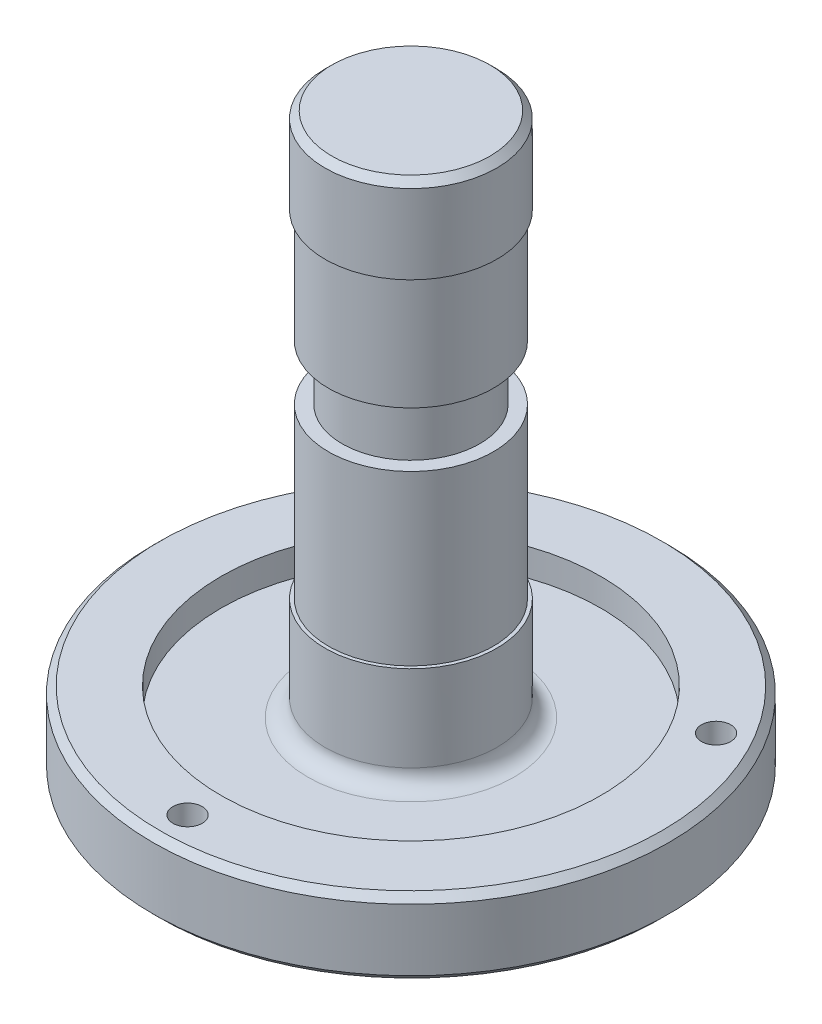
from build123d import *

# Parameters (mm, degrees)
CHANFREIN1_SIZE              = 2
CONG_1_R                     = 5
R_P_TITION_CIRCULAIRE1_COUNT = 3


with BuildPart() as part:
    # Esquisse1 → R_volution1 (revolve)
    with BuildSketch(Plane.XY, mode=Mode.PRIVATE) as r_volution1_sk:
        Polygon((34.9, 0), (34.9, 8), (75, 8), (75, 30), (55.25, 30), (55.25, 22), (25, 22), (25, 52), (24, 52), (24, 101), (20, 101), (20, 117), (24, 117), (24, 150), (25, 150), (25, 175), (0, 175), (0, 0), align=None)
    revolve(r_volution1_sk.sketch.rotate(Axis((0, 209.604915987, 0), (0, -1, 0)), 180), axis=Axis((0, 209.604915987, 0), (0, -1, 0)))

    # Chanfrein1
    chanfrein1_edges = [part.edges().sort_by_distance(p)[0] for p in [
        (25, 175, 0),
        (75, 30, 0),
        (75, 8, 0),
        (34.9, 0, 0),
    ]]
    chamfer(chanfrein1_edges, length=CHANFREIN1_SIZE)

    # Cong_1
    cong_1_edges = [part.edges().sort_by_distance(p)[0] for p in [
        (25, 22, 0),
    ]]
    fillet(cong_1_edges, radius=CONG_1_R)

    # Esquisse2 → Trou taraud_ M101 (revolve, cut)
    with BuildSketch(Plane(origin=(0, 8, 65), x_dir=(0, 0, -1), z_dir=(1, 0, 0))):
        Polygon((0, 0), (0, 30.053657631), (4.25, 27.5), (4.25, 0), align=None)
    trou_taraud_m101 = revolve(axis=Axis((0, 1.65, 65), (0, 1, 0)), mode=Mode.SUBTRACT)

    # R_p_tition circulaire1: Trou taraud_ M101 ×3 about axis
    r_p_tition_circulaire1_axis = Axis((0, 0, 0), (0, 1, 0))
    for i in range(1, R_P_TITION_CIRCULAIRE1_COUNT):
        add(trou_taraud_m101.rotate(r_p_tition_circulaire1_axis, i * 360 / R_P_TITION_CIRCULAIRE1_COUNT), mode=Mode.SUBTRACT)


solid = part.part
